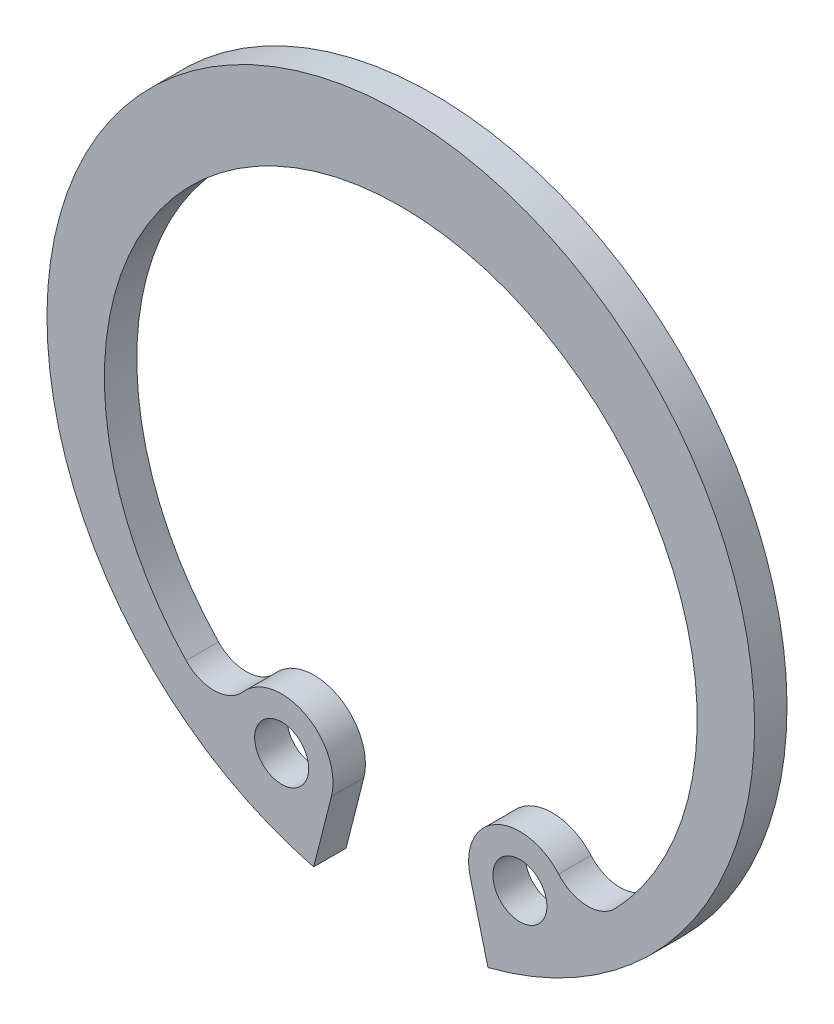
from build123d import *

# Parameters (mm, degrees)
BODYSKE_R  = 1
BODY_DEPTH = 1.2


with BuildPart() as part:
    # BodySke → Body (new body)
    with BuildSketch(Plane.XY):
        with BuildLine():
            Line((3.225876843, -12.69660264), (2.567976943, -10.107200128))
            ThreePointArc((2.567976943, -10.107200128), (3.528262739, -7.956031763), (5.843231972, -8.392599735))
            ThreePointArc((5.843231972, -8.392599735), (6.886638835, -8.882198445), (7.950924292, -8.439817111))
            ThreePointArc((7.950924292, -8.439817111), (0, 10.1), (-7.950924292, -8.439817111))
            ThreePointArc((-7.950924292, -8.439817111), (-6.886638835, -8.882198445), (-5.843231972, -8.392599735))
            ThreePointArc((-5.843231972, -8.392599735), (-3.528262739, -7.956031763), (-2.567976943, -10.107200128))
            Line((-2.567976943, -10.107200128), (-3.225876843, -12.69660264))
            ThreePointArc((-3.225876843, -12.69660264), (0, 13.1), (3.225876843, -12.69660264))
        make_face()
        with Locations((4.409468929, -9.63932486)):
            Circle(BODYSKE_R, mode=Mode.SUBTRACT)
        with Locations((-4.409468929, -9.63932486)):
            Circle(BODYSKE_R, mode=Mode.SUBTRACT)
    extrude(amount=-BODY_DEPTH)


solid = part.part
